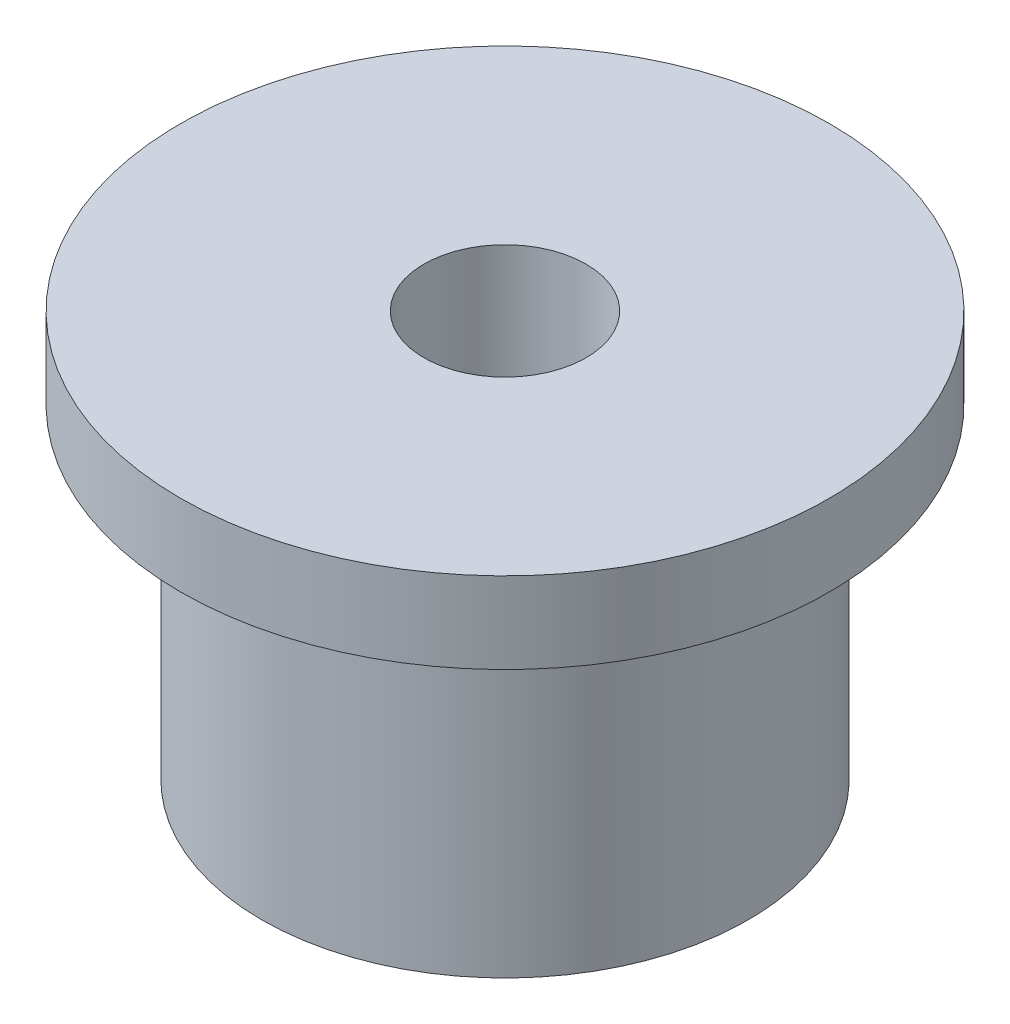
from build123d import *


with BuildPart() as part:
    # Sketch1 → Revolve1 (revolve)
    with BuildSketch(Plane.XY, mode=Mode.PRIVATE) as revolve1_sk:
        Polygon((25, 0), (25, 125), (100, 125), (100, 100), (75, 100), (75, 0), align=None)
    revolve(revolve1_sk.sketch.rotate(Axis((0, 0, 0), (0, 1, 0)), 90), axis=Axis((0, 0, 0), (0, 1, 0)))


solid = part.part
